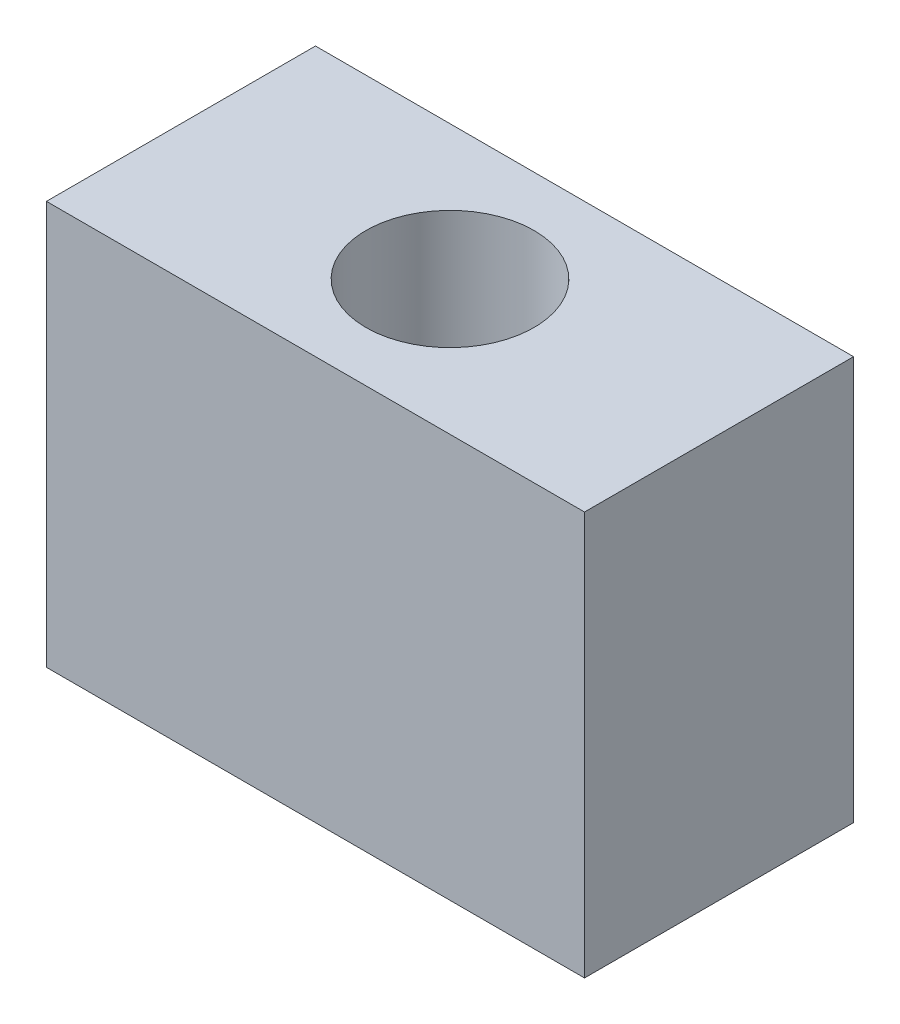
ISO-10303-21;
HEADER;
FILE_DESCRIPTION(('STEP AP214'),'2;1');
FILE_NAME('part.step','',(''),(''),'','','');
FILE_SCHEMA(('AUTOMOTIVE_DESIGN { 1 0 10303 214 1 1 1 1 }'));
ENDSEC;
DATA;
#1=APPLICATION_CONTEXT('core data for automotive mechanical design processes');
#2=APPLICATION_PROTOCOL_DEFINITION('international standard','automotive_design',2000,#1);
#3=PRODUCT_CONTEXT('',#1,'mechanical');
#4=PRODUCT('Part','Part','',(#3));
#5=PRODUCT_RELATED_PRODUCT_CATEGORY('part','',(#4));
#6=PRODUCT_DEFINITION_FORMATION('','',#4);
#7=PRODUCT_DEFINITION_CONTEXT('part definition',#1,'design');
#8=PRODUCT_DEFINITION('design','',#6,#7);
#9=PRODUCT_DEFINITION_SHAPE('','',#8);
#10=(LENGTH_UNIT() NAMED_UNIT(*) SI_UNIT(.MILLI.,.METRE.));
#11=(NAMED_UNIT(*) PLANE_ANGLE_UNIT() SI_UNIT($,.RADIAN.));
#12=(NAMED_UNIT(*) SI_UNIT($,.STERADIAN.) SOLID_ANGLE_UNIT());
#13=UNCERTAINTY_MEASURE_WITH_UNIT(LENGTH_MEASURE(1.E-05),#10,'distance_accuracy_value','');
#14=(GEOMETRIC_REPRESENTATION_CONTEXT(3) GLOBAL_UNCERTAINTY_ASSIGNED_CONTEXT((#13)) GLOBAL_UNIT_ASSIGNED_CONTEXT((#10,
#11,#12)) REPRESENTATION_CONTEXT('',''));
#15=CARTESIAN_POINT('',(0.,0.,0.));
#16=DIRECTION('',(0.,0.,1.));
#17=DIRECTION('',(1.,0.,0.));
#18=AXIS2_PLACEMENT_3D('',#15,#16,#17);
#19=CARTESIAN_POINT('',(-44.3184402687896,19.05,12.7));
#20=DIRECTION('',(0.,0.,-1.));
#21=DIRECTION('',(-1.,0.,0.));
#22=AXIS2_PLACEMENT_3D('',#19,#20,#21);
#23=PLANE('',#22);
#24=DIRECTION('',(1.,0.,0.));
#25=VECTOR('',#24,1.);
#26=CARTESIAN_POINT('',(-44.3184402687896,-19.05,12.7));
#27=LINE('',#26,#25);
#28=CARTESIAN_POINT('',(-25.4,-19.05,12.7));
#29=VERTEX_POINT('',#28);
#30=CARTESIAN_POINT('',(25.4,-19.05,12.7));
#31=VERTEX_POINT('',#30);
#32=EDGE_CURVE('E107',#29,#31,#27,.T.);
#33=ORIENTED_EDGE('',*,*,#32,.T.);
#34=DIRECTION('',(0.,-1.,0.));
#35=VECTOR('',#34,1.);
#36=CARTESIAN_POINT('',(25.4,19.05,12.7));
#37=LINE('',#36,#35);
#38=CARTESIAN_POINT('',(25.4,19.05,12.7));
#39=VERTEX_POINT('',#38);
#40=EDGE_CURVE('E13',#39,#31,#37,.T.);
#41=ORIENTED_EDGE('',*,*,#40,.F.);
#42=DIRECTION('',(1.,0.,0.));
#43=VECTOR('',#42,1.);
#44=CARTESIAN_POINT('',(-44.3184402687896,19.05,12.7));
#45=LINE('',#44,#43);
#46=CARTESIAN_POINT('',(-25.4,19.05,12.7));
#47=VERTEX_POINT('',#46);
#48=EDGE_CURVE('E93',#47,#39,#45,.T.);
#49=ORIENTED_EDGE('',*,*,#48,.F.);
#50=DIRECTION('',(0.,-1.,0.));
#51=VECTOR('',#50,1.);
#52=CARTESIAN_POINT('',(-25.4,19.05,12.7));
#53=LINE('',#52,#51);
#54=EDGE_CURVE('E60',#47,#29,#53,.T.);
#55=ORIENTED_EDGE('',*,*,#54,.T.);
#56=EDGE_LOOP('',(#33,#41,#49,#55));
#57=FACE_BOUND('',#56,.T.);
#58=ADVANCED_FACE('F44',(#57),#23,.F.);
#59=CARTESIAN_POINT('',(25.4,19.05,0.));
#60=DIRECTION('',(-1.,0.,0.));
#61=DIRECTION('',(0.,0.,1.));
#62=AXIS2_PLACEMENT_3D('',#59,#60,#61);
#63=PLANE('',#62);
#64=DIRECTION('',(0.,0.,-1.));
#65=VECTOR('',#64,1.);
#66=CARTESIAN_POINT('',(25.4,-19.05,0.));
#67=LINE('',#66,#65);
#68=CARTESIAN_POINT('',(25.4,-19.05,-12.7));
#69=VERTEX_POINT('',#68);
#70=EDGE_CURVE('E98',#31,#69,#67,.T.);
#71=ORIENTED_EDGE('',*,*,#70,.T.);
#72=DIRECTION('',(0.,-1.,0.));
#73=VECTOR('',#72,1.);
#74=CARTESIAN_POINT('',(25.4,19.05,-12.7));
#75=LINE('',#74,#73);
#76=CARTESIAN_POINT('',(25.4,19.05,-12.7));
#77=VERTEX_POINT('',#76);
#78=EDGE_CURVE('E52',#77,#69,#75,.T.);
#79=ORIENTED_EDGE('',*,*,#78,.F.);
#80=DIRECTION('',(0.,0.,-1.));
#81=VECTOR('',#80,1.);
#82=CARTESIAN_POINT('',(25.4,19.05,0.));
#83=LINE('',#82,#81);
#84=EDGE_CURVE('E85',#39,#77,#83,.T.);
#85=ORIENTED_EDGE('',*,*,#84,.F.);
#86=ORIENTED_EDGE('',*,*,#40,.T.);
#87=EDGE_LOOP('',(#71,#79,#85,#86));
#88=FACE_BOUND('',#87,.T.);
#89=ADVANCED_FACE('F97',(#88),#63,.F.);
#90=CARTESIAN_POINT('',(-44.3184402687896,19.05,-12.7));
#91=DIRECTION('',(0.,0.,-1.));
#92=DIRECTION('',(-1.,0.,0.));
#93=AXIS2_PLACEMENT_3D('',#90,#91,#92);
#94=PLANE('',#93);
#95=DIRECTION('',(1.,0.,0.));
#96=VECTOR('',#95,1.);
#97=CARTESIAN_POINT('',(-44.3184402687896,-19.05,-12.7));
#98=LINE('',#97,#96);
#99=CARTESIAN_POINT('',(-25.4,-19.05,-12.7));
#100=VERTEX_POINT('',#99);
#101=EDGE_CURVE('E111',#100,#69,#98,.T.);
#102=ORIENTED_EDGE('',*,*,#101,.F.);
#103=DIRECTION('',(0.,-1.,0.));
#104=VECTOR('',#103,1.);
#105=CARTESIAN_POINT('',(-25.4,19.05,-12.7));
#106=LINE('',#105,#104);
#107=CARTESIAN_POINT('',(-25.4,19.05,-12.7));
#108=VERTEX_POINT('',#107);
#109=EDGE_CURVE('E74',#108,#100,#106,.T.);
#110=ORIENTED_EDGE('',*,*,#109,.F.);
#111=DIRECTION('',(1.,0.,0.));
#112=VECTOR('',#111,1.);
#113=CARTESIAN_POINT('',(-44.3184402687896,19.05,-12.7));
#114=LINE('',#113,#112);
#115=EDGE_CURVE('E92',#108,#77,#114,.T.);
#116=ORIENTED_EDGE('',*,*,#115,.T.);
#117=ORIENTED_EDGE('',*,*,#78,.T.);
#118=EDGE_LOOP('',(#102,#110,#116,#117));
#119=FACE_BOUND('',#118,.T.);
#120=ADVANCED_FACE('F101',(#119),#94,.T.);
#121=CARTESIAN_POINT('',(-25.4,19.05,0.));
#122=DIRECTION('',(-1.,0.,0.));
#123=DIRECTION('',(0.,0.,1.));
#124=AXIS2_PLACEMENT_3D('',#121,#122,#123);
#125=PLANE('',#124);
#126=DIRECTION('',(0.,0.,-1.));
#127=VECTOR('',#126,1.);
#128=CARTESIAN_POINT('',(-25.4,-19.05,0.));
#129=LINE('',#128,#127);
#130=EDGE_CURVE('E113',#29,#100,#129,.T.);
#131=ORIENTED_EDGE('',*,*,#130,.F.);
#132=ORIENTED_EDGE('',*,*,#54,.F.);
#133=DIRECTION('',(0.,0.,-1.));
#134=VECTOR('',#133,1.);
#135=CARTESIAN_POINT('',(-25.4,19.05,0.));
#136=LINE('',#135,#134);
#137=EDGE_CURVE('E102',#47,#108,#136,.T.);
#138=ORIENTED_EDGE('',*,*,#137,.T.);
#139=ORIENTED_EDGE('',*,*,#109,.T.);
#140=EDGE_LOOP('',(#131,#132,#138,#139));
#141=FACE_BOUND('',#140,.T.);
#142=ADVANCED_FACE('F134',(#141),#125,.T.);
#143=CARTESIAN_POINT('',(-44.3184402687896,19.05,0.));
#144=DIRECTION('',(0.,1.,0.));
#145=DIRECTION('',(0.,0.,1.));
#146=AXIS2_PLACEMENT_3D('',#143,#144,#145);
#147=PLANE('',#146);
#148=CARTESIAN_POINT('',(0.,19.05,0.));
#149=DIRECTION('',(0.,1.,0.));
#150=DIRECTION('',(0.,0.,1.));
#151=AXIS2_PLACEMENT_3D('',#148,#149,#150);
#152=CIRCLE('',#151,7.9375);
#153=CARTESIAN_POINT('',(0.,19.05,7.9375));
#154=VERTEX_POINT('',#153);
#155=EDGE_CURVE('E119',#154,#154,#152,.T.);
#156=ORIENTED_EDGE('',*,*,#155,.F.);
#157=EDGE_LOOP('',(#156));
#158=FACE_BOUND('',#157,.T.);
#159=ORIENTED_EDGE('',*,*,#48,.T.);
#160=ORIENTED_EDGE('',*,*,#84,.T.);
#161=ORIENTED_EDGE('',*,*,#115,.F.);
#162=ORIENTED_EDGE('',*,*,#137,.F.);
#163=EDGE_LOOP('',(#159,#160,#161,#162));
#164=FACE_BOUND('',#163,.T.);
#165=ADVANCED_FACE('F89',(#158,#164),#147,.T.);
#166=CARTESIAN_POINT('',(-44.3184402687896,-19.05,0.));
#167=DIRECTION('',(0.,1.,0.));
#168=DIRECTION('',(0.,0.,1.));
#169=AXIS2_PLACEMENT_3D('',#166,#167,#168);
#170=PLANE('',#169);
#171=CARTESIAN_POINT('',(0.,-19.05,0.));
#172=DIRECTION('',(0.,1.,0.));
#173=DIRECTION('',(0.,0.,1.));
#174=AXIS2_PLACEMENT_3D('',#171,#172,#173);
#175=CIRCLE('',#174,7.9375);
#176=CARTESIAN_POINT('',(0.,-19.05,7.9375));
#177=VERTEX_POINT('',#176);
#178=EDGE_CURVE('E109',#177,#177,#175,.T.);
#179=ORIENTED_EDGE('',*,*,#178,.T.);
#180=EDGE_LOOP('',(#179));
#181=FACE_BOUND('',#180,.T.);
#182=ORIENTED_EDGE('',*,*,#32,.F.);
#183=ORIENTED_EDGE('',*,*,#130,.T.);
#184=ORIENTED_EDGE('',*,*,#101,.T.);
#185=ORIENTED_EDGE('',*,*,#70,.F.);
#186=EDGE_LOOP('',(#182,#183,#184,#185));
#187=FACE_BOUND('',#186,.T.);
#188=ADVANCED_FACE('F125',(#181,#187),#170,.F.);
#189=CARTESIAN_POINT('',(0.,-19.05,0.));
#190=DIRECTION('',(0.,1.,0.));
#191=DIRECTION('',(0.,0.,1.));
#192=AXIS2_PLACEMENT_3D('',#189,#190,#191);
#193=CYLINDRICAL_SURFACE('',#192,7.9375);
#194=CARTESIAN_POINT('',(0.,-19.05,7.9375));
#195=CARTESIAN_POINT('',(0.,-18.653125,7.9375));
#196=CARTESIAN_POINT('',(0.,-18.25625,7.9375));
#197=CARTESIAN_POINT('',(0.,-17.4625,7.9375));
#198=CARTESIAN_POINT('',(0.,-17.065625,7.9375));
#199=CARTESIAN_POINT('',(0.,-16.271875,7.9375));
#200=CARTESIAN_POINT('',(0.,-15.875,7.9375));
#201=CARTESIAN_POINT('',(0.,-15.08125,7.9375));
#202=CARTESIAN_POINT('',(0.,-14.684375,7.9375));
#203=CARTESIAN_POINT('',(0.,-13.890625,7.9375));
#204=CARTESIAN_POINT('',(0.,-13.49375,7.9375));
#205=CARTESIAN_POINT('',(0.,-12.7,7.9375));
#206=CARTESIAN_POINT('',(0.,-12.303125,7.9375));
#207=CARTESIAN_POINT('',(0.,-11.509375,7.9375));
#208=CARTESIAN_POINT('',(0.,-11.1125,7.9375));
#209=CARTESIAN_POINT('',(0.,-10.31875,7.9375));
#210=CARTESIAN_POINT('',(0.,-9.921875,7.9375));
#211=CARTESIAN_POINT('',(0.,-9.128125,7.9375));
#212=CARTESIAN_POINT('',(0.,-8.73125,7.9375));
#213=CARTESIAN_POINT('',(0.,-7.9375,7.9375));
#214=CARTESIAN_POINT('',(0.,-7.540625,7.9375));
#215=CARTESIAN_POINT('',(0.,-6.746875,7.9375));
#216=CARTESIAN_POINT('',(0.,-6.35,7.9375));
#217=CARTESIAN_POINT('',(0.,-5.55625,7.9375));
#218=CARTESIAN_POINT('',(0.,-5.159375,7.9375));
#219=CARTESIAN_POINT('',(0.,-4.365625,7.9375));
#220=CARTESIAN_POINT('',(0.,-3.96875,7.9375));
#221=CARTESIAN_POINT('',(0.,-3.175,7.9375));
#222=CARTESIAN_POINT('',(0.,-2.778125,7.9375));
#223=CARTESIAN_POINT('',(0.,-1.984375,7.9375));
#224=CARTESIAN_POINT('',(0.,-1.5875,7.9375));
#225=CARTESIAN_POINT('',(0.,-0.79375,7.9375));
#226=CARTESIAN_POINT('',(0.,-0.396875,7.9375));
#227=CARTESIAN_POINT('',(0.,0.396875,7.9375));
#228=CARTESIAN_POINT('',(0.,0.79375,7.9375));
#229=CARTESIAN_POINT('',(0.,1.5875,7.9375));
#230=CARTESIAN_POINT('',(0.,1.984375,7.9375));
#231=CARTESIAN_POINT('',(0.,2.778125,7.9375));
#232=CARTESIAN_POINT('',(0.,3.175,7.9375));
#233=CARTESIAN_POINT('',(0.,3.96875,7.9375));
#234=CARTESIAN_POINT('',(0.,4.365625,7.9375));
#235=CARTESIAN_POINT('',(0.,5.159375,7.9375));
#236=CARTESIAN_POINT('',(0.,5.55625,7.9375));
#237=CARTESIAN_POINT('',(0.,6.35,7.9375));
#238=CARTESIAN_POINT('',(0.,6.746875,7.9375));
#239=CARTESIAN_POINT('',(0.,7.540625,7.9375));
#240=CARTESIAN_POINT('',(0.,7.9375,7.9375));
#241=CARTESIAN_POINT('',(0.,8.73125,7.9375));
#242=CARTESIAN_POINT('',(0.,9.128125,7.9375));
#243=CARTESIAN_POINT('',(0.,9.921875,7.9375));
#244=CARTESIAN_POINT('',(0.,10.31875,7.9375));
#245=CARTESIAN_POINT('',(0.,11.1125,7.9375));
#246=CARTESIAN_POINT('',(0.,11.509375,7.9375));
#247=CARTESIAN_POINT('',(0.,12.303125,7.9375));
#248=CARTESIAN_POINT('',(0.,12.7,7.9375));
#249=CARTESIAN_POINT('',(0.,13.49375,7.9375));
#250=CARTESIAN_POINT('',(0.,13.890625,7.9375));
#251=CARTESIAN_POINT('',(0.,14.684375,7.9375));
#252=CARTESIAN_POINT('',(0.,15.08125,7.9375));
#253=CARTESIAN_POINT('',(0.,15.875,7.9375));
#254=CARTESIAN_POINT('',(0.,16.271875,7.9375));
#255=CARTESIAN_POINT('',(0.,17.065625,7.9375));
#256=CARTESIAN_POINT('',(0.,17.4625,7.9375));
#257=CARTESIAN_POINT('',(0.,18.25625,7.9375));
#258=CARTESIAN_POINT('',(0.,18.653125,7.9375));
#259=CARTESIAN_POINT('',(0.,19.05,7.9375));
#260=B_SPLINE_CURVE_WITH_KNOTS('',3,(#194,#195,#196,#197,#198,#199,#200,#201,#202,#203,#204,
#205,#206,#207,#208,#209,#210,#211,#212,#213,#214,#215,#216,#217,#218,#219,#220,#221,#222,#223,
#224,#225,#226,#227,#228,#229,#230,#231,#232,#233,#234,#235,#236,#237,#238,#239,#240,#241,#242,
#243,#244,#245,#246,#247,#248,#249,#250,#251,#252,#253,#254,#255,#256,#257,#258,#259),
.UNSPECIFIED.,.F.,.F.,(4,2,2,2,2,2,2,2,2,2,2,2,2,2,2,2,2,2,2,2,2,2,2,2,2,2,2,2,2,2,2,2,4),(0.,
1.190625,2.38125,3.571875,4.7625,5.953125,7.14375,8.334375,9.525,10.715625,11.90625,13.096875,
14.2875,15.478125,16.66875,17.859375,19.05,20.240625,21.43125,22.621875,23.8125,25.003125,
26.19375,27.384375,28.575,29.765625,30.95625,32.146875,33.3375,34.528125,35.71875,36.909375,
38.1),.UNSPECIFIED.);
#261=EDGE_CURVE('BSEAM127',#177,#154,#260,.T.);
#262=ORIENTED_EDGE('',*,*,#178,.F.);
#263=ORIENTED_EDGE('',*,*,#155,.T.);
#264=ORIENTED_EDGE('',*,*,#261,.T.);
#265=ORIENTED_EDGE('',*,*,#261,.F.);
#266=EDGE_LOOP('',(#262,#264,#263,#265));
#267=FACE_BOUND('',#266,.T.);
#268=ADVANCED_FACE('F127',(#267),#193,.F.);
#269=CLOSED_SHELL('',(#58,#89,#120,#142,#165,#188,#268));
#270=MANIFOLD_SOLID_BREP('B2',#269);
#271=ADVANCED_BREP_SHAPE_REPRESENTATION('',(#18,#270),#14);
#272=SHAPE_DEFINITION_REPRESENTATION(#9,#271);
ENDSEC;
END-ISO-10303-21;
